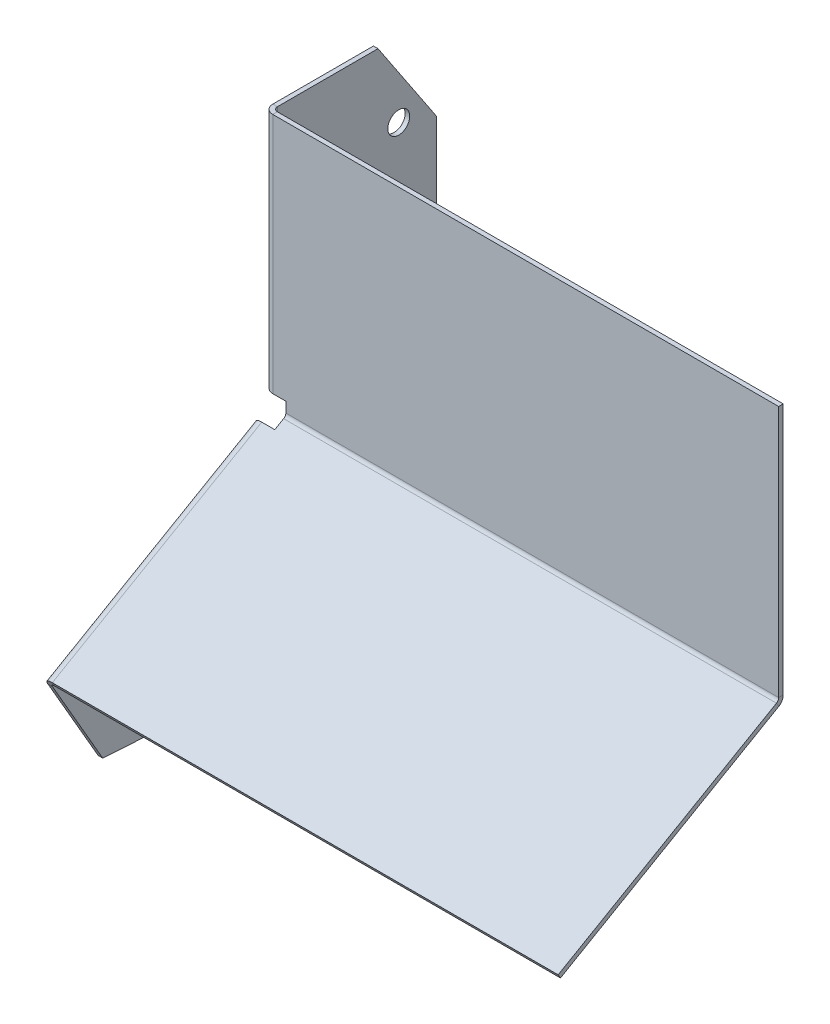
ISO-10303-21;
HEADER;
FILE_DESCRIPTION(('STEP AP214'),'2;1');
FILE_NAME('part.step','',(''),(''),'','','');
FILE_SCHEMA(('AUTOMOTIVE_DESIGN { 1 0 10303 214 1 1 1 1 }'));
ENDSEC;
DATA;
#1=APPLICATION_CONTEXT('core data for automotive mechanical design processes');
#2=APPLICATION_PROTOCOL_DEFINITION('international standard','automotive_design',2000,#1);
#3=PRODUCT_CONTEXT('',#1,'mechanical');
#4=PRODUCT('Part','Part','',(#3));
#5=PRODUCT_RELATED_PRODUCT_CATEGORY('part','',(#4));
#6=PRODUCT_DEFINITION_FORMATION('','',#4);
#7=PRODUCT_DEFINITION_CONTEXT('part definition',#1,'design');
#8=PRODUCT_DEFINITION('design','',#6,#7);
#9=PRODUCT_DEFINITION_SHAPE('','',#8);
#10=(LENGTH_UNIT() NAMED_UNIT(*) SI_UNIT(.MILLI.,.METRE.));
#11=(NAMED_UNIT(*) PLANE_ANGLE_UNIT() SI_UNIT($,.RADIAN.));
#12=(NAMED_UNIT(*) SI_UNIT($,.STERADIAN.) SOLID_ANGLE_UNIT());
#13=UNCERTAINTY_MEASURE_WITH_UNIT(LENGTH_MEASURE(1.E-05),#10,'distance_accuracy_value','');
#14=(GEOMETRIC_REPRESENTATION_CONTEXT(3) GLOBAL_UNCERTAINTY_ASSIGNED_CONTEXT((#13)) GLOBAL_UNIT_ASSIGNED_CONTEXT((#10,
#11,#12)) REPRESENTATION_CONTEXT('',''));
#15=CARTESIAN_POINT('',(0.,0.,0.));
#16=DIRECTION('',(0.,0.,1.));
#17=DIRECTION('',(1.,0.,0.));
#18=AXIS2_PLACEMENT_3D('',#15,#16,#17);
#19=CARTESIAN_POINT('',(88.2544282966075,-19.7841838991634,40.9061950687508));
#20=DIRECTION('',(1.,0.,0.));
#21=DIRECTION('',(0.,-0.866025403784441,-0.499999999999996));
#22=AXIS2_PLACEMENT_3D('',#19,#20,#21);
#23=PLANE('',#22);
#24=DIRECTION('',(0.,-0.866025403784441,-0.499999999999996));
#25=VECTOR('',#24,1.);
#26=CARTESIAN_POINT('',(88.2544282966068,-38.4816723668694,30.1111950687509));
#27=LINE('',#26,#25);
#28=CARTESIAN_POINT('',(88.2544282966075,-23.3220520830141,38.8636059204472));
#29=VERTEX_POINT('',#28);
#30=CARTESIAN_POINT('',(88.2544282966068,-38.4816723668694,30.1111950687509));
#31=VERTEX_POINT('',#30);
#32=EDGE_CURVE('E290',#29,#31,#27,.T.);
#33=ORIENTED_EDGE('',*,*,#32,.F.);
#34=DIRECTION('',(0.,0.499999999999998,-0.866025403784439));
#35=VECTOR('',#34,1.);
#36=CARTESIAN_POINT('',(88.2544282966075,-23.3220520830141,38.8636059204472));
#37=LINE('',#36,#35);
#38=CARTESIAN_POINT('',(88.2544282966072,-2.28767708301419,2.43099971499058));
#39=VERTEX_POINT('',#38);
#40=EDGE_CURVE('E303',#29,#39,#37,.T.);
#41=ORIENTED_EDGE('',*,*,#40,.T.);
#42=DIRECTION('',(0.,0.866025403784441,0.499999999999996));
#43=VECTOR('',#42,1.);
#44=CARTESIAN_POINT('',(88.2544282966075,1.25019110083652,4.47358886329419));
#45=LINE('',#44,#43);
#46=CARTESIAN_POINT('',(88.2544282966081,-26.2461154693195,-11.4014111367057));
#47=VERTEX_POINT('',#46);
#48=EDGE_CURVE('E287',#47,#39,#45,.T.);
#49=ORIENTED_EDGE('',*,*,#48,.F.);
#50=DIRECTION('',(0.,0.499999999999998,-0.866025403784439));
#51=VECTOR('',#50,1.);
#52=CARTESIAN_POINT('',(88.2544282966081,-26.2461154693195,-11.4014111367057));
#53=LINE('',#52,#51);
#54=CARTESIAN_POINT('',(88.2544282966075,-39.6604904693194,11.8329679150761));
#55=VERTEX_POINT('',#54);
#56=EDGE_CURVE('E266',#55,#47,#53,.T.);
#57=ORIENTED_EDGE('',*,*,#56,.F.);
#58=DIRECTION('',(0.,-0.0643593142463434,-0.997926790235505));
#59=VECTOR('',#58,1.);
#60=CARTESIAN_POINT('',(88.2544282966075,-39.6604904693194,11.8329679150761));
#61=LINE('',#60,#59);
#62=EDGE_CURVE('E269',#31,#55,#61,.T.);
#63=ORIENTED_EDGE('',*,*,#62,.F.);
#64=EDGE_LOOP('',(#33,#41,#49,#57,#63));
#65=FACE_BOUND('',#64,.T.);
#66=CARTESIAN_POINT('',(88.2544282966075,-35.1470492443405,17.1153434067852));
#67=DIRECTION('',(1.,0.,0.));
#68=DIRECTION('',(0.,0.,-0.999999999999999));
#69=AXIS2_PLACEMENT_3D('',#66,#67,#68);
#70=CIRCLE('',#69,1.905);
#71=CARTESIAN_POINT('',(88.2544282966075,-35.1470492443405,19.0203434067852));
#72=VERTEX_POINT('',#71);
#73=EDGE_CURVE('E349',#72,#72,#70,.F.);
#74=ORIENTED_EDGE('',*,*,#73,.F.);
#75=EDGE_LOOP('',(#74));
#76=FACE_BOUND('',#75,.T.);
#77=ADVANCED_FACE('F32',(#65,#76),#23,.F.);
#78=CARTESIAN_POINT('',(89.0481782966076,-19.7841838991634,40.9061950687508));
#79=DIRECTION('',(1.,0.,0.));
#80=DIRECTION('',(0.,-0.866025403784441,-0.499999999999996));
#81=AXIS2_PLACEMENT_3D('',#78,#79,#80);
#82=PLANE('',#81);
#83=DIRECTION('',(0.,0.499999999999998,-0.866025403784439));
#84=VECTOR('',#83,1.);
#85=CARTESIAN_POINT('',(89.0481782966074,-23.3220520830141,38.8636059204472));
#86=LINE('',#85,#84);
#87=CARTESIAN_POINT('',(89.0481782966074,-23.3220520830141,38.8636059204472));
#88=VERTEX_POINT('',#87);
#89=CARTESIAN_POINT('',(89.0481782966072,-2.28767708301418,2.43099971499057));
#90=VERTEX_POINT('',#89);
#91=EDGE_CURVE('E306',#88,#90,#86,.T.);
#92=ORIENTED_EDGE('',*,*,#91,.F.);
#93=DIRECTION('',(0.,-0.866025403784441,-0.499999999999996));
#94=VECTOR('',#93,1.);
#95=CARTESIAN_POINT('',(89.0481782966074,-38.4816723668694,30.1111950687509));
#96=LINE('',#95,#94);
#97=CARTESIAN_POINT('',(89.0481782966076,-38.4816723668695,30.1111950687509));
#98=VERTEX_POINT('',#97);
#99=EDGE_CURVE('E292',#88,#98,#96,.T.);
#100=ORIENTED_EDGE('',*,*,#99,.T.);
#101=DIRECTION('',(0.,-0.0643593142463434,-0.997926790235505));
#102=VECTOR('',#101,1.);
#103=CARTESIAN_POINT('',(89.0481782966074,-39.6604904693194,11.8329679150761));
#104=LINE('',#103,#102);
#105=CARTESIAN_POINT('',(89.0481782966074,-39.6604904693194,11.8329679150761));
#106=VERTEX_POINT('',#105);
#107=EDGE_CURVE('E272',#98,#106,#104,.T.);
#108=ORIENTED_EDGE('',*,*,#107,.T.);
#109=DIRECTION('',(0.,0.499999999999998,-0.866025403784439));
#110=VECTOR('',#109,1.);
#111=CARTESIAN_POINT('',(89.0481782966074,-26.2461154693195,-11.4014111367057));
#112=LINE('',#111,#110);
#113=CARTESIAN_POINT('',(89.0481782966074,-26.2461154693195,-11.4014111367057));
#114=VERTEX_POINT('',#113);
#115=EDGE_CURVE('E275',#106,#114,#112,.T.);
#116=ORIENTED_EDGE('',*,*,#115,.T.);
#117=DIRECTION('',(0.,0.866025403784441,0.499999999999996));
#118=VECTOR('',#117,1.);
#119=CARTESIAN_POINT('',(89.0481782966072,1.25019110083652,4.47358886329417));
#120=LINE('',#119,#118);
#121=EDGE_CURVE('E294',#114,#90,#120,.T.);
#122=ORIENTED_EDGE('',*,*,#121,.T.);
#123=EDGE_LOOP('',(#92,#100,#108,#116,#122));
#124=FACE_BOUND('',#123,.T.);
#125=CARTESIAN_POINT('',(89.0481782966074,-35.1470492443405,17.1153434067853));
#126=DIRECTION('',(1.,0.,0.));
#127=DIRECTION('',(0.,0.,-0.999999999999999));
#128=AXIS2_PLACEMENT_3D('',#125,#126,#127);
#129=CIRCLE('',#128,1.905);
#130=CARTESIAN_POINT('',(89.0481782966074,-35.1470492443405,19.0203434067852));
#131=VERTEX_POINT('',#130);
#132=EDGE_CURVE('E36',#131,#131,#129,.F.);
#133=ORIENTED_EDGE('',*,*,#132,.T.);
#134=EDGE_LOOP('',(#133));
#135=FACE_BOUND('',#134,.T.);
#136=ADVANCED_FACE('F463',(#124,#135),#82,.T.);
#137=CARTESIAN_POINT('',(88.254428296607,-44.45,3.82057170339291));
#138=DIRECTION('',(1.,0.,0.));
#139=DIRECTION('',(0.,0.,-0.999999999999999));
#140=AXIS2_PLACEMENT_3D('',#137,#138,#139);
#141=PLANE('',#140);
#142=DIRECTION('',(0.,0.,-0.999999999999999));
#143=VECTOR('',#142,1.);
#144=CARTESIAN_POINT('',(88.2544282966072,2.38124999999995,-27.9294282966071));
#145=LINE('',#144,#143);
#146=CARTESIAN_POINT('',(88.2544282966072,2.38124999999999,-0.264606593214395));
#147=VERTEX_POINT('',#146);
#148=CARTESIAN_POINT('',(88.2544282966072,2.38124999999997,-27.9294282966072));
#149=VERTEX_POINT('',#148);
#150=EDGE_CURVE('E401',#147,#149,#145,.T.);
#151=ORIENTED_EDGE('',*,*,#150,.F.);
#152=DIRECTION('',(0.,1.,0.));
#153=VECTOR('',#152,1.);
#154=CARTESIAN_POINT('',(88.254428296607,-44.45,-0.264606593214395));
#155=LINE('',#154,#153);
#156=CARTESIAN_POINT('',(88.254428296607,44.45,-0.264606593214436));
#157=VERTEX_POINT('',#156);
#158=EDGE_CURVE('E414',#147,#157,#155,.T.);
#159=ORIENTED_EDGE('',*,*,#158,.T.);
#160=DIRECTION('',(0.,0.,0.999999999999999));
#161=VECTOR('',#160,1.);
#162=CARTESIAN_POINT('',(88.2544282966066,44.4500000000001,89.5455717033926));
#163=LINE('',#162,#161);
#164=CARTESIAN_POINT('',(88.254428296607,44.45,-17.7694282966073));
#165=VERTEX_POINT('',#164);
#166=EDGE_CURVE('E398',#165,#157,#163,.T.);
#167=ORIENTED_EDGE('',*,*,#166,.F.);
#168=DIRECTION('',(0.,0.832050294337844,0.554700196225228));
#169=VECTOR('',#168,1.);
#170=CARTESIAN_POINT('',(88.254428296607,44.45,-17.7694282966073));
#171=LINE('',#170,#169);
#172=CARTESIAN_POINT('',(88.254428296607,29.21,-27.9294282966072));
#173=VERTEX_POINT('',#172);
#174=EDGE_CURVE('E377',#173,#165,#171,.T.);
#175=ORIENTED_EDGE('',*,*,#174,.F.);
#176=DIRECTION('',(0.,1.,0.));
#177=VECTOR('',#176,1.);
#178=CARTESIAN_POINT('',(88.254428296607,29.21,-27.9294282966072));
#179=LINE('',#178,#177);
#180=EDGE_CURVE('E380',#149,#173,#179,.T.);
#181=ORIENTED_EDGE('',*,*,#180,.F.);
#182=EDGE_LOOP('',(#151,#159,#167,#175,#181));
#183=FACE_BOUND('',#182,.T.);
#184=CARTESIAN_POINT('',(88.254428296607,31.5279507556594,-21.3794857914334));
#185=DIRECTION('',(1.,0.,0.));
#186=DIRECTION('',(0.,0.,-0.999999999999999));
#187=AXIS2_PLACEMENT_3D('',#184,#185,#186);
#188=CIRCLE('',#187,1.905);
#189=CARTESIAN_POINT('',(88.254428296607,31.5279507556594,-19.4744857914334));
#190=VERTEX_POINT('',#189);
#191=EDGE_CURVE('E204',#190,#190,#188,.F.);
#192=ORIENTED_EDGE('',*,*,#191,.F.);
#193=EDGE_LOOP('',(#192));
#194=FACE_BOUND('',#193,.T.);
#195=ADVANCED_FACE('F460',(#183,#194),#141,.F.);
#196=CARTESIAN_POINT('',(89.0481782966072,-44.45,3.82057170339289));
#197=DIRECTION('',(1.,0.,0.));
#198=DIRECTION('',(0.,0.,-0.999999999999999));
#199=AXIS2_PLACEMENT_3D('',#196,#197,#198);
#200=PLANE('',#199);
#201=DIRECTION('',(0.,1.,0.));
#202=VECTOR('',#201,1.);
#203=CARTESIAN_POINT('',(89.0481782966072,-44.45,-0.264606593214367));
#204=LINE('',#203,#202);
#205=CARTESIAN_POINT('',(89.0481782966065,2.38125,-0.264606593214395));
#206=VERTEX_POINT('',#205);
#207=CARTESIAN_POINT('',(89.0481782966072,44.45,-0.26460659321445));
#208=VERTEX_POINT('',#207);
#209=EDGE_CURVE('E417',#206,#208,#204,.T.);
#210=ORIENTED_EDGE('',*,*,#209,.F.);
#211=DIRECTION('',(0.,0.,-0.999999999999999));
#212=VECTOR('',#211,1.);
#213=CARTESIAN_POINT('',(89.0481782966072,2.38124999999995,-27.9294282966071));
#214=LINE('',#213,#212);
#215=CARTESIAN_POINT('',(89.0481782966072,2.38124999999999,-27.9294282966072));
#216=VERTEX_POINT('',#215);
#217=EDGE_CURVE('E406',#206,#216,#214,.T.);
#218=ORIENTED_EDGE('',*,*,#217,.T.);
#219=DIRECTION('',(0.,1.,0.));
#220=VECTOR('',#219,1.);
#221=CARTESIAN_POINT('',(89.0481782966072,29.21,-27.9294282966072));
#222=LINE('',#221,#220);
#223=CARTESIAN_POINT('',(89.0481782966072,29.21,-27.9294282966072));
#224=VERTEX_POINT('',#223);
#225=EDGE_CURVE('E383',#216,#224,#222,.T.);
#226=ORIENTED_EDGE('',*,*,#225,.T.);
#227=DIRECTION('',(0.,0.832050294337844,0.554700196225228));
#228=VECTOR('',#227,1.);
#229=CARTESIAN_POINT('',(89.0481782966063,44.45,-17.7694282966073));
#230=LINE('',#229,#228);
#231=CARTESIAN_POINT('',(89.0481782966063,44.45,-17.7694282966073));
#232=VERTEX_POINT('',#231);
#233=EDGE_CURVE('E386',#224,#232,#230,.T.);
#234=ORIENTED_EDGE('',*,*,#233,.T.);
#235=DIRECTION('',(0.,0.,0.999999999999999));
#236=VECTOR('',#235,1.);
#237=CARTESIAN_POINT('',(89.0481782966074,44.4500000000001,89.5455717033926));
#238=LINE('',#237,#236);
#239=EDGE_CURVE('E403',#232,#208,#238,.T.);
#240=ORIENTED_EDGE('',*,*,#239,.T.);
#241=EDGE_LOOP('',(#210,#218,#226,#234,#240));
#242=FACE_BOUND('',#241,.T.);
#243=CARTESIAN_POINT('',(89.0481782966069,31.5279507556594,-21.3794857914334));
#244=DIRECTION('',(1.,0.,0.));
#245=DIRECTION('',(0.,0.,-0.999999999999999));
#246=AXIS2_PLACEMENT_3D('',#243,#244,#245);
#247=CIRCLE('',#246,1.905);
#248=CARTESIAN_POINT('',(89.0481782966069,31.5279507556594,-19.4744857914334));
#249=VERTEX_POINT('',#248);
#250=EDGE_CURVE('E347',#249,#249,#247,.F.);
#251=ORIENTED_EDGE('',*,*,#250,.T.);
#252=EDGE_LOOP('',(#251));
#253=FACE_BOUND('',#252,.T.);
#254=ADVANCED_FACE('F440',(#242,#253),#200,.T.);
#255=CARTESIAN_POINT('',(92.0750000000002,-22.6621407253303,39.2446059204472));
#256=DIRECTION('',(0.,-0.86602540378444,-0.499999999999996));
#257=DIRECTION('',(-1.,0.,0.));
#258=AXIS2_PLACEMENT_3D('',#255,#256,#257);
#259=PLANE('',#258);
#260=DIRECTION('',(0.,0.499999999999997,-0.866025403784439));
#261=VECTOR('',#260,1.);
#262=CARTESIAN_POINT('',(92.0749999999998,0.753484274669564,-1.31244627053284));
#263=LINE('',#262,#261);
#264=CARTESIAN_POINT('',(92.075,-1.62776572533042,2.81199971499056));
#265=VERTEX_POINT('',#264);
#266=CARTESIAN_POINT('',(92.0750000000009,-0.740533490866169,1.27526840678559));
#267=VERTEX_POINT('',#266);
#268=EDGE_CURVE('E324',#265,#267,#263,.T.);
#269=ORIENTED_EDGE('',*,*,#268,.T.);
#270=DIRECTION('',(1.,0.,0.));
#271=VECTOR('',#270,1.);
#272=CARTESIAN_POINT('',(92.0750000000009,-0.740533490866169,1.27526840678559));
#273=LINE('',#272,#271);
#274=CARTESIAN_POINT('',(177.8,-0.740533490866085,1.27526840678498));
#275=VERTEX_POINT('',#274);
#276=EDGE_CURVE('E56',#267,#275,#273,.T.);
#277=ORIENTED_EDGE('',*,*,#276,.T.);
#278=DIRECTION('',(0.,-0.499999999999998,0.866025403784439));
#279=VECTOR('',#278,1.);
#280=CARTESIAN_POINT('',(177.8,-22.6621407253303,39.2446059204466));
#281=LINE('',#280,#279);
#282=CARTESIAN_POINT('',(177.8,-22.6621407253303,39.2446059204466));
#283=VERTEX_POINT('',#282);
#284=EDGE_CURVE('E317',#275,#283,#281,.T.);
#285=ORIENTED_EDGE('',*,*,#284,.T.);
#286=DIRECTION('',(-1.,0.,0.));
#287=VECTOR('',#286,1.);
#288=CARTESIAN_POINT('',(70.4849999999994,-22.6621407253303,39.2446059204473));
#289=LINE('',#288,#287);
#290=CARTESIAN_POINT('',(89.8101782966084,-22.6621407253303,39.2446059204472));
#291=VERTEX_POINT('',#290);
#292=EDGE_CURVE('E319',#283,#291,#289,.T.);
#293=ORIENTED_EDGE('',*,*,#292,.T.);
#294=DIRECTION('',(0.,0.499999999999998,-0.866025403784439));
#295=VECTOR('',#294,1.);
#296=CARTESIAN_POINT('',(89.8101782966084,-22.6621407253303,39.2446059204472));
#297=LINE('',#296,#295);
#298=CARTESIAN_POINT('',(89.8101782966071,-1.62776572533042,2.81199971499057));
#299=VERTEX_POINT('',#298);
#300=EDGE_CURVE('E332',#291,#299,#297,.T.);
#301=ORIENTED_EDGE('',*,*,#300,.T.);
#302=DIRECTION('',(1.,0.,0.));
#303=VECTOR('',#302,1.);
#304=CARTESIAN_POINT('',(92.075,-1.62776572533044,2.81199971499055));
#305=LINE('',#304,#303);
#306=EDGE_CURVE('E322',#299,#265,#305,.T.);
#307=ORIENTED_EDGE('',*,*,#306,.T.);
#308=EDGE_LOOP('',(#269,#277,#285,#293,#301,#307));
#309=FACE_BOUND('',#308,.T.);
#310=ADVANCED_FACE('F507',(#309),#259,.T.);
#311=CARTESIAN_POINT('',(92.075,-21.9747330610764,39.6414809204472));
#312=DIRECTION('',(0.,-0.86602540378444,-0.499999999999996));
#313=DIRECTION('',(-1.,0.,0.));
#314=AXIS2_PLACEMENT_3D('',#311,#312,#313);
#315=PLANE('',#314);
#316=DIRECTION('',(1.,0.,0.));
#317=VECTOR('',#316,1.);
#318=CARTESIAN_POINT('',(92.075,-0.053125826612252,1.6721434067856));
#319=LINE('',#318,#317);
#320=CARTESIAN_POINT('',(92.075,-0.0531258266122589,1.67214340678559));
#321=VERTEX_POINT('',#320);
#322=CARTESIAN_POINT('',(177.8,-0.0531258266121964,1.67214340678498));
#323=VERTEX_POINT('',#322);
#324=EDGE_CURVE('E345',#321,#323,#319,.T.);
#325=ORIENTED_EDGE('',*,*,#324,.F.);
#326=DIRECTION('',(0.,0.499999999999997,-0.866025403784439));
#327=VECTOR('',#326,1.);
#328=CARTESIAN_POINT('',(92.075,1.44089193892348,-0.915571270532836));
#329=LINE('',#328,#327);
#330=CARTESIAN_POINT('',(92.0750000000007,-0.940358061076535,3.20887471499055));
#331=VERTEX_POINT('',#330);
#332=EDGE_CURVE('E308',#331,#321,#329,.T.);
#333=ORIENTED_EDGE('',*,*,#332,.F.);
#334=DIRECTION('',(1.,0.,0.));
#335=VECTOR('',#334,1.);
#336=CARTESIAN_POINT('',(92.0750000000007,-0.940358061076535,3.20887471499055));
#337=LINE('',#336,#335);
#338=CARTESIAN_POINT('',(89.810178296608,-0.940358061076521,3.20887471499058));
#339=VERTEX_POINT('',#338);
#340=EDGE_CURVE('E310',#339,#331,#337,.T.);
#341=ORIENTED_EDGE('',*,*,#340,.F.);
#342=DIRECTION('',(0.,0.499999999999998,-0.866025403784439));
#343=VECTOR('',#342,1.);
#344=CARTESIAN_POINT('',(89.8101782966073,-21.9747330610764,39.6414809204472));
#345=LINE('',#344,#343);
#346=CARTESIAN_POINT('',(89.8101782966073,-21.9747330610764,39.6414809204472));
#347=VERTEX_POINT('',#346);
#348=EDGE_CURVE('E335',#347,#339,#345,.T.);
#349=ORIENTED_EDGE('',*,*,#348,.F.);
#350=DIRECTION('',(-1.,0.,0.));
#351=VECTOR('',#350,1.);
#352=CARTESIAN_POINT('',(70.4850000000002,-21.9747330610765,39.6414809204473));
#353=LINE('',#352,#351);
#354=CARTESIAN_POINT('',(177.8,-21.9747330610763,39.6414809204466));
#355=VERTEX_POINT('',#354);
#356=EDGE_CURVE('E312',#355,#347,#353,.T.);
#357=ORIENTED_EDGE('',*,*,#356,.F.);
#358=DIRECTION('',(0.,-0.499999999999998,0.866025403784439));
#359=VECTOR('',#358,1.);
#360=CARTESIAN_POINT('',(177.8,-21.9747330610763,39.6414809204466));
#361=LINE('',#360,#359);
#362=EDGE_CURVE('E315',#323,#355,#361,.T.);
#363=ORIENTED_EDGE('',*,*,#362,.F.);
#364=EDGE_LOOP('',(#325,#333,#341,#349,#357,#363));
#365=FACE_BOUND('',#364,.T.);
#366=ADVANCED_FACE('F504',(#365),#315,.F.);
#367=CARTESIAN_POINT('',(177.799999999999,-239.309910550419,-85.8370423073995));
#368=DIRECTION('',(-1.,0.,0.));
#369=DIRECTION('',(0.,0.499999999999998,-0.866025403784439));
#370=AXIS2_PLACEMENT_3D('',#367,#368,#369);
#371=PLANE('',#370);
#372=DIRECTION('',(0.,-0.86602540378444,-0.499999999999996));
#373=VECTOR('',#372,1.);
#374=CARTESIAN_POINT('',(177.799999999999,-217.388303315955,-123.806379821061));
#375=LINE('',#374,#373);
#376=EDGE_CURVE('E41',#323,#275,#375,.T.);
#377=ORIENTED_EDGE('',*,*,#376,.F.);
#378=ORIENTED_EDGE('',*,*,#362,.T.);
#379=DIRECTION('',(0.,0.86602540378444,0.499999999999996));
#380=VECTOR('',#379,1.);
#381=CARTESIAN_POINT('',(177.799999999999,-239.309910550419,-85.8370423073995));
#382=LINE('',#381,#380);
#383=EDGE_CURVE('E329',#283,#355,#382,.T.);
#384=ORIENTED_EDGE('',*,*,#383,.F.);
#385=ORIENTED_EDGE('',*,*,#284,.F.);
#386=EDGE_LOOP('',(#377,#378,#384,#385));
#387=FACE_BOUND('',#386,.T.);
#388=ADVANCED_FACE('F34',(#387),#371,.F.);
#389=CARTESIAN_POINT('',(70.4849999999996,-239.309910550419,-85.8370423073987));
#390=DIRECTION('',(0.,0.499999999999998,-0.866025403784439));
#391=DIRECTION('',(1.,0.,0.));
#392=AXIS2_PLACEMENT_3D('',#389,#390,#391);
#393=PLANE('',#392);
#394=DIRECTION('',(0.,0.86602540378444,0.499999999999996));
#395=VECTOR('',#394,1.);
#396=CARTESIAN_POINT('',(89.8101782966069,-239.309910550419,-85.8370423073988));
#397=LINE('',#396,#395);
#398=EDGE_CURVE('E338',#291,#347,#397,.T.);
#399=ORIENTED_EDGE('',*,*,#398,.F.);
#400=ORIENTED_EDGE('',*,*,#292,.F.);
#401=ORIENTED_EDGE('',*,*,#383,.T.);
#402=ORIENTED_EDGE('',*,*,#356,.T.);
#403=EDGE_LOOP('',(#399,#400,#401,#402));
#404=FACE_BOUND('',#403,.T.);
#405=ADVANCED_FACE('F516',(#404),#393,.F.);
#406=CARTESIAN_POINT('',(92.0749999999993,-218.275535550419,-122.269648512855));
#407=DIRECTION('',(0.,-0.499999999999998,0.866025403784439));
#408=DIRECTION('',(-1.,0.,0.));
#409=AXIS2_PLACEMENT_3D('',#406,#407,#408);
#410=PLANE('',#409);
#411=DIRECTION('',(0.,-0.86602540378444,-0.499999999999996));
#412=VECTOR('',#411,1.);
#413=CARTESIAN_POINT('',(89.8101782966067,-218.27553555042,-122.269648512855));
#414=LINE('',#413,#412);
#415=EDGE_CURVE('E341',#339,#299,#414,.T.);
#416=ORIENTED_EDGE('',*,*,#415,.F.);
#417=ORIENTED_EDGE('',*,*,#340,.T.);
#418=DIRECTION('',(0.,0.86602540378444,0.499999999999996));
#419=VECTOR('',#418,1.);
#420=CARTESIAN_POINT('',(92.0749999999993,-218.275535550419,-122.269648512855));
#421=LINE('',#420,#419);
#422=EDGE_CURVE('E326',#265,#331,#421,.T.);
#423=ORIENTED_EDGE('',*,*,#422,.F.);
#424=ORIENTED_EDGE('',*,*,#306,.F.);
#425=EDGE_LOOP('',(#416,#417,#423,#424));
#426=FACE_BOUND('',#425,.T.);
#427=ADVANCED_FACE('F513',(#426),#410,.F.);
#428=CARTESIAN_POINT('',(92.0749999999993,-215.894285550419,-126.394094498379));
#429=DIRECTION('',(1.,0.,0.));
#430=DIRECTION('',(0.,-0.86602540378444,-0.499999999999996));
#431=AXIS2_PLACEMENT_3D('',#428,#429,#430);
#432=PLANE('',#431);
#433=DIRECTION('',(0.,0.86602540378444,0.499999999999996));
#434=VECTOR('',#433,1.);
#435=CARTESIAN_POINT('',(92.0749999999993,-217.388303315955,-123.80637982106));
#436=LINE('',#435,#434);
#437=EDGE_CURVE('E11',#267,#321,#436,.T.);
#438=ORIENTED_EDGE('',*,*,#437,.F.);
#439=ORIENTED_EDGE('',*,*,#268,.F.);
#440=ORIENTED_EDGE('',*,*,#422,.T.);
#441=ORIENTED_EDGE('',*,*,#332,.T.);
#442=EDGE_LOOP('',(#438,#439,#440,#441));
#443=FACE_BOUND('',#442,.T.);
#444=ADVANCED_FACE('F502',(#443),#432,.F.);
#445=CARTESIAN_POINT('',(339.211474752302,-38.4816723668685,30.1111950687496));
#446=DIRECTION('',(0.,0.499999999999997,-0.866025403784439));
#447=DIRECTION('',(0.,0.866025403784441,0.499999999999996));
#448=AXIS2_PLACEMENT_3D('',#445,#446,#447);
#449=PLANE('',#448);
#450=ORIENTED_EDGE('',*,*,#99,.F.);
#451=DIRECTION('',(-1.,0.,0.));
#452=VECTOR('',#451,1.);
#453=CARTESIAN_POINT('',(339.211474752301,-23.3220520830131,38.8636059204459));
#454=LINE('',#453,#452);
#455=EDGE_CURVE('E300',#88,#29,#454,.T.);
#456=ORIENTED_EDGE('',*,*,#455,.T.);
#457=ORIENTED_EDGE('',*,*,#32,.T.);
#458=DIRECTION('',(-1.,0.,0.));
#459=VECTOR('',#458,1.);
#460=CARTESIAN_POINT('',(189.748170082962,-38.481672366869,30.1111950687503));
#461=LINE('',#460,#459);
#462=EDGE_CURVE('E284',#98,#31,#461,.T.);
#463=ORIENTED_EDGE('',*,*,#462,.F.);
#464=EDGE_LOOP('',(#450,#456,#457,#463));
#465=FACE_BOUND('',#464,.T.);
#466=ADVANCED_FACE('F498',(#465),#449,.F.);
#467=CARTESIAN_POINT('',(339.211474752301,1.25019110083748,4.47358886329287));
#468=DIRECTION('',(0.,-0.499999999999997,0.86602540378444));
#469=DIRECTION('',(0.,-0.866025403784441,-0.499999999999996));
#470=AXIS2_PLACEMENT_3D('',#467,#468,#469);
#471=PLANE('',#470);
#472=ORIENTED_EDGE('',*,*,#48,.T.);
#473=DIRECTION('',(1.,0.,0.));
#474=VECTOR('',#473,1.);
#475=CARTESIAN_POINT('',(339.211474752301,-2.28767708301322,2.43099971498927));
#476=LINE('',#475,#474);
#477=EDGE_CURVE('E297',#39,#90,#476,.T.);
#478=ORIENTED_EDGE('',*,*,#477,.T.);
#479=ORIENTED_EDGE('',*,*,#121,.F.);
#480=DIRECTION('',(-1.,0.,0.));
#481=VECTOR('',#480,1.);
#482=CARTESIAN_POINT('',(189.748170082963,-26.2461154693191,-11.4014111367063));
#483=LINE('',#482,#481);
#484=EDGE_CURVE('E278',#114,#47,#483,.T.);
#485=ORIENTED_EDGE('',*,*,#484,.T.);
#486=EDGE_LOOP('',(#472,#478,#479,#485));
#487=FACE_BOUND('',#486,.T.);
#488=ADVANCED_FACE('F495',(#487),#471,.F.);
#489=CARTESIAN_POINT('',(189.748170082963,-39.660490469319,11.8329679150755));
#490=DIRECTION('',(0.,0.997926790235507,-0.0643593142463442));
#491=DIRECTION('',(0.,0.0643593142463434,0.997926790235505));
#492=AXIS2_PLACEMENT_3D('',#489,#490,#491);
#493=PLANE('',#492);
#494=ORIENTED_EDGE('',*,*,#462,.T.);
#495=ORIENTED_EDGE('',*,*,#62,.T.);
#496=DIRECTION('',(-1.,0.,0.));
#497=VECTOR('',#496,1.);
#498=CARTESIAN_POINT('',(189.748170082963,-39.660490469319,11.8329679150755));
#499=LINE('',#498,#497);
#500=EDGE_CURVE('E281',#106,#55,#499,.T.);
#501=ORIENTED_EDGE('',*,*,#500,.F.);
#502=ORIENTED_EDGE('',*,*,#107,.F.);
#503=EDGE_LOOP('',(#494,#495,#501,#502));
#504=FACE_BOUND('',#503,.T.);
#505=ADVANCED_FACE('F492',(#504),#493,.F.);
#506=CARTESIAN_POINT('',(189.748170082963,-26.2461154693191,-11.4014111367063));
#507=DIRECTION('',(0.,0.866025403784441,0.499999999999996));
#508=DIRECTION('',(0.,-0.499999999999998,0.866025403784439));
#509=AXIS2_PLACEMENT_3D('',#506,#507,#508);
#510=PLANE('',#509);
#511=ORIENTED_EDGE('',*,*,#500,.T.);
#512=ORIENTED_EDGE('',*,*,#56,.T.);
#513=ORIENTED_EDGE('',*,*,#484,.F.);
#514=ORIENTED_EDGE('',*,*,#115,.F.);
#515=EDGE_LOOP('',(#511,#512,#513,#514));
#516=FACE_BOUND('',#515,.T.);
#517=ADVANCED_FACE('F544',(#516),#510,.F.);
#518=CARTESIAN_POINT('',(89.8101782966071,-2.28767708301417,2.43099971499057));
#519=DIRECTION('',(0.,-0.499999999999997,0.866025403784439));
#520=DIRECTION('',(0.,-0.866025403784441,-0.499999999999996));
#521=AXIS2_PLACEMENT_3D('',#518,#519,#520);
#522=PLANE('',#521);
#523=ORIENTED_EDGE('',*,*,#415,.T.);
#524=CARTESIAN_POINT('',(89.8101782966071,-2.28767708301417,2.43099971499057));
#525=DIRECTION('',(0.,-0.499999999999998,0.866025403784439));
#526=DIRECTION('',(0.,-0.866025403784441,-0.499999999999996));
#527=AXIS2_PLACEMENT_3D('',#524,#525,#526);
#528=CIRCLE('',#527,0.762000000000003);
#529=EDGE_CURVE('E258',#90,#299,#528,.F.);
#530=ORIENTED_EDGE('',*,*,#529,.F.);
#531=ORIENTED_EDGE('',*,*,#477,.F.);
#532=CARTESIAN_POINT('',(89.8101782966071,-2.28767708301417,2.43099971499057));
#533=DIRECTION('',(0.,-0.499999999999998,0.866025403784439));
#534=DIRECTION('',(0.,-0.866025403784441,-0.499999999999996));
#535=AXIS2_PLACEMENT_3D('',#532,#533,#534);
#536=CIRCLE('',#535,1.55575);
#537=EDGE_CURVE('E263',#39,#339,#536,.F.);
#538=ORIENTED_EDGE('',*,*,#537,.T.);
#539=EDGE_LOOP('',(#523,#530,#531,#538));
#540=FACE_BOUND('',#539,.T.);
#541=ADVANCED_FACE('F536',(#540),#522,.F.);
#542=CARTESIAN_POINT('',(89.8101782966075,-23.3220520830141,38.8636059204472));
#543=DIRECTION('',(0.,0.500000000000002,-0.866025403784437));
#544=DIRECTION('',(0.,0.866025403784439,0.5));
#545=AXIS2_PLACEMENT_3D('',#542,#543,#544);
#546=PLANE('',#545);
#547=ORIENTED_EDGE('',*,*,#455,.F.);
#548=CARTESIAN_POINT('',(89.8101782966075,-23.3220520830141,38.8636059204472));
#549=DIRECTION('',(0.,-0.499999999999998,0.866025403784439));
#550=DIRECTION('',(0.,-0.866025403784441,-0.499999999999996));
#551=AXIS2_PLACEMENT_3D('',#548,#549,#550);
#552=CIRCLE('',#551,0.762000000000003);
#553=EDGE_CURVE('E255',#291,#88,#552,.T.);
#554=ORIENTED_EDGE('',*,*,#553,.F.);
#555=ORIENTED_EDGE('',*,*,#398,.T.);
#556=CARTESIAN_POINT('',(89.8101782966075,-23.3220520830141,38.8636059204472));
#557=DIRECTION('',(0.,-0.499999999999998,0.866025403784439));
#558=DIRECTION('',(0.,-0.866025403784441,-0.499999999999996));
#559=AXIS2_PLACEMENT_3D('',#556,#557,#558);
#560=CIRCLE('',#559,1.55575);
#561=EDGE_CURVE('E261',#347,#29,#560,.T.);
#562=ORIENTED_EDGE('',*,*,#561,.T.);
#563=EDGE_LOOP('',(#547,#554,#555,#562));
#564=FACE_BOUND('',#563,.T.);
#565=ADVANCED_FACE('F530',(#564),#546,.F.);
#566=CARTESIAN_POINT('',(89.8101782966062,72.8079743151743,-127.638483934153));
#567=DIRECTION('',(0.,-0.499999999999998,0.866025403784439));
#568=DIRECTION('',(0.,-0.866025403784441,-0.499999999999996));
#569=AXIS2_PLACEMENT_3D('',#566,#567,#568);
#570=CYLINDRICAL_SURFACE('',#569,1.55575);
#571=ORIENTED_EDGE('',*,*,#561,.F.);
#572=ORIENTED_EDGE('',*,*,#348,.T.);
#573=ORIENTED_EDGE('',*,*,#537,.F.);
#574=ORIENTED_EDGE('',*,*,#40,.F.);
#575=EDGE_LOOP('',(#571,#572,#573,#574));
#576=FACE_BOUND('',#575,.T.);
#577=ADVANCED_FACE('F550',(#576),#570,.T.);
#578=CARTESIAN_POINT('',(89.8101782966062,72.8079743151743,-127.638483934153));
#579=DIRECTION('',(0.,-0.499999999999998,0.866025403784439));
#580=DIRECTION('',(0.,-0.866025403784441,-0.499999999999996));
#581=AXIS2_PLACEMENT_3D('',#578,#579,#580);
#582=CYLINDRICAL_SURFACE('',#581,0.762000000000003);
#583=ORIENTED_EDGE('',*,*,#553,.T.);
#584=ORIENTED_EDGE('',*,*,#91,.T.);
#585=ORIENTED_EDGE('',*,*,#529,.T.);
#586=ORIENTED_EDGE('',*,*,#300,.F.);
#587=EDGE_LOOP('',(#583,#584,#585,#586));
#588=FACE_BOUND('',#587,.T.);
#589=ADVANCED_FACE('F533',(#588),#582,.F.);
#590=CARTESIAN_POINT('',(92.0749999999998,-44.45,1.29114340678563));
#591=DIRECTION('',(0.,0.,-0.999999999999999));
#592=DIRECTION('',(-1.,0.,0.));
#593=AXIS2_PLACEMENT_3D('',#590,#591,#592);
#594=PLANE('',#593);
#595=DIRECTION('',(0.,1.,0.));
#596=VECTOR('',#595,1.);
#597=CARTESIAN_POINT('',(92.0750000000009,2.38124999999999,1.29114340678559));
#598=LINE('',#597,#596);
#599=CARTESIAN_POINT('',(92.075,0.606785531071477,1.29114340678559));
#600=VERTEX_POINT('',#599);
#601=CARTESIAN_POINT('',(92.0750000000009,2.38124999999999,1.29114340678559));
#602=VERTEX_POINT('',#601);
#603=EDGE_CURVE('E210',#600,#602,#598,.T.);
#604=ORIENTED_EDGE('',*,*,#603,.F.);
#605=DIRECTION('',(1.,0.,0.));
#606=VECTOR('',#605,1.);
#607=CARTESIAN_POINT('',(92.075,0.606785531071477,1.29114340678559));
#608=LINE('',#607,#606);
#609=CARTESIAN_POINT('',(177.799999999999,0.606785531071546,1.29114340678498));
#610=VERTEX_POINT('',#609);
#611=EDGE_CURVE('E184',#600,#610,#608,.T.);
#612=ORIENTED_EDGE('',*,*,#611,.T.);
#613=DIRECTION('',(0.,-1.,0.));
#614=VECTOR('',#613,1.);
#615=CARTESIAN_POINT('',(177.799999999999,-44.4499999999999,1.29114340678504));
#616=LINE('',#615,#614);
#617=CARTESIAN_POINT('',(177.8,44.4500000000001,1.29114340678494));
#618=VERTEX_POINT('',#617);
#619=EDGE_CURVE('E219',#618,#610,#616,.T.);
#620=ORIENTED_EDGE('',*,*,#619,.F.);
#621=DIRECTION('',(1.,0.,0.));
#622=VECTOR('',#621,1.);
#623=CARTESIAN_POINT('',(177.8,44.4500000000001,1.29114340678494));
#624=LINE('',#623,#622);
#625=CARTESIAN_POINT('',(89.8101782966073,44.45,1.29114340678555));
#626=VERTEX_POINT('',#625);
#627=EDGE_CURVE('E223',#626,#618,#624,.T.);
#628=ORIENTED_EDGE('',*,*,#627,.F.);
#629=DIRECTION('',(0.,1.,0.));
#630=VECTOR('',#629,1.);
#631=CARTESIAN_POINT('',(89.8101782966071,-44.45,1.29114340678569));
#632=LINE('',#631,#630);
#633=CARTESIAN_POINT('',(89.810178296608,2.38125,1.2911434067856));
#634=VERTEX_POINT('',#633);
#635=EDGE_CURVE('E240',#634,#626,#632,.T.);
#636=ORIENTED_EDGE('',*,*,#635,.F.);
#637=DIRECTION('',(-1.,0.,0.));
#638=VECTOR('',#637,1.);
#639=CARTESIAN_POINT('',(60.3250000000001,2.38124999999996,1.29114340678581));
#640=LINE('',#639,#638);
#641=EDGE_CURVE('E217',#602,#634,#640,.T.);
#642=ORIENTED_EDGE('',*,*,#641,.F.);
#643=EDGE_LOOP('',(#604,#612,#620,#628,#636,#642));
#644=FACE_BOUND('',#643,.T.);
#645=ADVANCED_FACE('F215',(#644),#594,.F.);
#646=CARTESIAN_POINT('',(177.799999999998,-44.45,-249.665903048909));
#647=DIRECTION('',(-1.,0.,0.));
#648=DIRECTION('',(0.,1.,0.));
#649=AXIS2_PLACEMENT_3D('',#646,#647,#648);
#650=PLANE('',#649);
#651=ORIENTED_EDGE('',*,*,#619,.T.);
#652=DIRECTION('',(0.,0.,-0.999999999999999));
#653=VECTOR('',#652,1.);
#654=CARTESIAN_POINT('',(177.799999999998,0.606785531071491,-249.665903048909));
#655=LINE('',#654,#653);
#656=CARTESIAN_POINT('',(177.8,0.60678553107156,0.497393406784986));
#657=VERTEX_POINT('',#656);
#658=EDGE_CURVE('E196',#610,#657,#655,.T.);
#659=ORIENTED_EDGE('',*,*,#658,.T.);
#660=DIRECTION('',(0.,-1.,0.));
#661=VECTOR('',#660,1.);
#662=CARTESIAN_POINT('',(177.799999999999,-44.4499999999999,0.497393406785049));
#663=LINE('',#662,#661);
#664=CARTESIAN_POINT('',(177.800000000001,44.4500000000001,0.497393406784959));
#665=VERTEX_POINT('',#664);
#666=EDGE_CURVE('E228',#665,#657,#663,.T.);
#667=ORIENTED_EDGE('',*,*,#666,.F.);
#668=DIRECTION('',(0.,0.,0.999999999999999));
#669=VECTOR('',#668,1.);
#670=CARTESIAN_POINT('',(177.799999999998,44.45,-249.665903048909));
#671=LINE('',#670,#669);
#672=EDGE_CURVE('E237',#665,#618,#671,.T.);
#673=ORIENTED_EDGE('',*,*,#672,.T.);
#674=EDGE_LOOP('',(#651,#659,#667,#673));
#675=FACE_BOUND('',#674,.T.);
#676=ADVANCED_FACE('F424',(#675),#650,.F.);
#677=CARTESIAN_POINT('',(92.0749999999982,2.38124999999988,-249.665903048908));
#678=DIRECTION('',(1.,0.,0.));
#679=DIRECTION('',(0.,0.,-0.999999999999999));
#680=AXIS2_PLACEMENT_3D('',#677,#678,#679);
#681=PLANE('',#680);
#682=DIRECTION('',(0.,1.,0.));
#683=VECTOR('',#682,1.);
#684=CARTESIAN_POINT('',(92.075,2.38125,0.49739340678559));
#685=LINE('',#684,#683);
#686=CARTESIAN_POINT('',(92.075,0.606785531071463,0.49739340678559));
#687=VERTEX_POINT('',#686);
#688=CARTESIAN_POINT('',(92.075,2.38125000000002,0.497393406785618));
#689=VERTEX_POINT('',#688);
#690=EDGE_CURVE('E212',#687,#689,#685,.T.);
#691=ORIENTED_EDGE('',*,*,#690,.F.);
#692=DIRECTION('',(0.,0.,0.999999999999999));
#693=VECTOR('',#692,1.);
#694=CARTESIAN_POINT('',(92.0749999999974,0.606785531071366,-249.665903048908));
#695=LINE('',#694,#693);
#696=EDGE_CURVE('E202',#687,#600,#695,.T.);
#697=ORIENTED_EDGE('',*,*,#696,.T.);
#698=ORIENTED_EDGE('',*,*,#603,.T.);
#699=DIRECTION('',(0.,0.,0.999999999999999));
#700=VECTOR('',#699,1.);
#701=CARTESIAN_POINT('',(92.0749999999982,2.38124999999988,-249.665903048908));
#702=LINE('',#701,#700);
#703=EDGE_CURVE('E235',#689,#602,#702,.T.);
#704=ORIENTED_EDGE('',*,*,#703,.F.);
#705=EDGE_LOOP('',(#691,#697,#698,#704));
#706=FACE_BOUND('',#705,.T.);
#707=ADVANCED_FACE('F208',(#706),#681,.F.);
#708=CARTESIAN_POINT('',(92.075,-44.45,0.497393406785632));
#709=DIRECTION('',(0.,0.,-0.999999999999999));
#710=DIRECTION('',(-1.,0.,0.));
#711=AXIS2_PLACEMENT_3D('',#708,#709,#710);
#712=PLANE('',#711);
#713=DIRECTION('',(1.,0.,0.));
#714=VECTOR('',#713,1.);
#715=CARTESIAN_POINT('',(92.075,0.606785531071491,0.497393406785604));
#716=LINE('',#715,#714);
#717=EDGE_CURVE('E195',#687,#657,#716,.T.);
#718=ORIENTED_EDGE('',*,*,#717,.F.);
#719=ORIENTED_EDGE('',*,*,#690,.T.);
#720=DIRECTION('',(-1.,0.,0.));
#721=VECTOR('',#720,1.);
#722=CARTESIAN_POINT('',(60.3250000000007,2.38124999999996,0.497393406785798));
#723=LINE('',#722,#721);
#724=CARTESIAN_POINT('',(89.8101782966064,2.38124999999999,0.497393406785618));
#725=VERTEX_POINT('',#724);
#726=EDGE_CURVE('E232',#689,#725,#723,.T.);
#727=ORIENTED_EDGE('',*,*,#726,.T.);
#728=DIRECTION('',(0.,1.,0.));
#729=VECTOR('',#728,1.);
#730=CARTESIAN_POINT('',(89.8101782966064,-44.45,0.497393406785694));
#731=LINE('',#730,#729);
#732=CARTESIAN_POINT('',(89.8101782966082,44.45,0.497393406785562));
#733=VERTEX_POINT('',#732);
#734=EDGE_CURVE('E213',#725,#733,#731,.T.);
#735=ORIENTED_EDGE('',*,*,#734,.T.);
#736=DIRECTION('',(1.,0.,0.));
#737=VECTOR('',#736,1.);
#738=CARTESIAN_POINT('',(177.800000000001,44.4500000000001,0.497393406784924));
#739=LINE('',#738,#737);
#740=EDGE_CURVE('E221',#733,#665,#739,.T.);
#741=ORIENTED_EDGE('',*,*,#740,.T.);
#742=ORIENTED_EDGE('',*,*,#666,.T.);
#743=EDGE_LOOP('',(#718,#719,#727,#735,#741,#742));
#744=FACE_BOUND('',#743,.T.);
#745=ADVANCED_FACE('F427',(#744),#712,.T.);
#746=CARTESIAN_POINT('',(177.799999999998,44.45,-249.665903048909));
#747=DIRECTION('',(0.,-1.,0.));
#748=DIRECTION('',(0.,0.,0.999999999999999));
#749=AXIS2_PLACEMENT_3D('',#746,#747,#748);
#750=PLANE('',#749);
#751=DIRECTION('',(0.,0.,-0.999999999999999));
#752=VECTOR('',#751,1.);
#753=CARTESIAN_POINT('',(89.8101782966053,44.4499999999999,-249.665903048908));
#754=LINE('',#753,#752);
#755=EDGE_CURVE('E243',#626,#733,#754,.T.);
#756=ORIENTED_EDGE('',*,*,#755,.F.);
#757=ORIENTED_EDGE('',*,*,#627,.T.);
#758=ORIENTED_EDGE('',*,*,#672,.F.);
#759=ORIENTED_EDGE('',*,*,#740,.F.);
#760=EDGE_LOOP('',(#756,#757,#758,#759));
#761=FACE_BOUND('',#760,.T.);
#762=ADVANCED_FACE('F421',(#761),#750,.F.);
#763=CARTESIAN_POINT('',(60.3249999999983,2.38124999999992,-249.665903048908));
#764=DIRECTION('',(0.,1.,0.));
#765=DIRECTION('',(1.,0.,0.));
#766=AXIS2_PLACEMENT_3D('',#763,#764,#765);
#767=PLANE('',#766);
#768=DIRECTION('',(0.,0.,0.999999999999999));
#769=VECTOR('',#768,1.);
#770=CARTESIAN_POINT('',(89.8101782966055,2.3812499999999,-249.665903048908));
#771=LINE('',#770,#769);
#772=EDGE_CURVE('E246',#725,#634,#771,.T.);
#773=ORIENTED_EDGE('',*,*,#772,.F.);
#774=ORIENTED_EDGE('',*,*,#726,.F.);
#775=ORIENTED_EDGE('',*,*,#703,.T.);
#776=ORIENTED_EDGE('',*,*,#641,.T.);
#777=EDGE_LOOP('',(#773,#774,#775,#776));
#778=FACE_BOUND('',#777,.T.);
#779=ADVANCED_FACE('F589',(#778),#767,.F.);
#780=CARTESIAN_POINT('',(339.211474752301,44.45,89.5455717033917));
#781=DIRECTION('',(0.,-1.,0.));
#782=DIRECTION('',(-1.,0.,0.));
#783=AXIS2_PLACEMENT_3D('',#780,#781,#782);
#784=PLANE('',#783);
#785=ORIENTED_EDGE('',*,*,#166,.T.);
#786=DIRECTION('',(1.,0.,0.));
#787=VECTOR('',#786,1.);
#788=CARTESIAN_POINT('',(339.211474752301,44.4499999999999,-0.264606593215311));
#789=LINE('',#788,#787);
#790=EDGE_CURVE('E411',#157,#208,#789,.T.);
#791=ORIENTED_EDGE('',*,*,#790,.T.);
#792=ORIENTED_EDGE('',*,*,#239,.F.);
#793=DIRECTION('',(-1.,0.,0.));
#794=VECTOR('',#793,1.);
#795=CARTESIAN_POINT('',(189.748170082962,44.45,-17.7694282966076));
#796=LINE('',#795,#794);
#797=EDGE_CURVE('E389',#232,#165,#796,.T.);
#798=ORIENTED_EDGE('',*,*,#797,.T.);
#799=EDGE_LOOP('',(#785,#791,#792,#798));
#800=FACE_BOUND('',#799,.T.);
#801=ADVANCED_FACE('F454',(#800),#784,.F.);
#802=CARTESIAN_POINT('',(339.211474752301,2.38124999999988,-27.929428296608));
#803=DIRECTION('',(0.,1.,0.));
#804=DIRECTION('',(0.,0.,0.999999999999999));
#805=AXIS2_PLACEMENT_3D('',#802,#803,#804);
#806=PLANE('',#805);
#807=ORIENTED_EDGE('',*,*,#217,.F.);
#808=DIRECTION('',(-1.,0.,0.));
#809=VECTOR('',#808,1.);
#810=CARTESIAN_POINT('',(339.211474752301,2.3812499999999,-0.264606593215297));
#811=LINE('',#810,#809);
#812=EDGE_CURVE('E408',#206,#147,#811,.T.);
#813=ORIENTED_EDGE('',*,*,#812,.T.);
#814=ORIENTED_EDGE('',*,*,#150,.T.);
#815=DIRECTION('',(-1.,0.,0.));
#816=VECTOR('',#815,1.);
#817=CARTESIAN_POINT('',(189.748170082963,2.38125000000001,-27.9294282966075));
#818=LINE('',#817,#816);
#819=EDGE_CURVE('E395',#216,#149,#818,.T.);
#820=ORIENTED_EDGE('',*,*,#819,.F.);
#821=EDGE_LOOP('',(#807,#813,#814,#820));
#822=FACE_BOUND('',#821,.T.);
#823=ADVANCED_FACE('F444',(#822),#806,.F.);
#824=CARTESIAN_POINT('',(189.748170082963,29.21,-27.9294282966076));
#825=DIRECTION('',(0.,0.,0.999999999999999));
#826=DIRECTION('',(0.,-1.,0.));
#827=AXIS2_PLACEMENT_3D('',#824,#825,#826);
#828=PLANE('',#827);
#829=ORIENTED_EDGE('',*,*,#819,.T.);
#830=ORIENTED_EDGE('',*,*,#180,.T.);
#831=DIRECTION('',(-1.,0.,0.));
#832=VECTOR('',#831,1.);
#833=CARTESIAN_POINT('',(189.748170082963,29.21,-27.9294282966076));
#834=LINE('',#833,#832);
#835=EDGE_CURVE('E392',#224,#173,#834,.T.);
#836=ORIENTED_EDGE('',*,*,#835,.F.);
#837=ORIENTED_EDGE('',*,*,#225,.F.);
#838=EDGE_LOOP('',(#829,#830,#836,#837));
#839=FACE_BOUND('',#838,.T.);
#840=ADVANCED_FACE('F448',(#839),#828,.F.);
#841=CARTESIAN_POINT('',(189.748170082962,44.45,-17.7694282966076));
#842=DIRECTION('',(0.,-0.554700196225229,0.832050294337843));
#843=DIRECTION('',(0.,-0.832050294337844,-0.554700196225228));
#844=AXIS2_PLACEMENT_3D('',#841,#842,#843);
#845=PLANE('',#844);
#846=ORIENTED_EDGE('',*,*,#835,.T.);
#847=ORIENTED_EDGE('',*,*,#174,.T.);
#848=ORIENTED_EDGE('',*,*,#797,.F.);
#849=ORIENTED_EDGE('',*,*,#233,.F.);
#850=EDGE_LOOP('',(#846,#847,#848,#849));
#851=FACE_BOUND('',#850,.T.);
#852=ADVANCED_FACE('F452',(#851),#845,.F.);
#853=CARTESIAN_POINT('',(89.8101782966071,44.45,-0.26460659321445));
#854=DIRECTION('',(0.,-1.,0.));
#855=DIRECTION('',(-1.,0.,0.));
#856=AXIS2_PLACEMENT_3D('',#853,#854,#855);
#857=PLANE('',#856);
#858=ORIENTED_EDGE('',*,*,#755,.T.);
#859=CARTESIAN_POINT('',(89.8101782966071,44.45,-0.26460659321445));
#860=DIRECTION('',(0.,-1.,0.));
#861=DIRECTION('',(0.,0.,-0.999999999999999));
#862=AXIS2_PLACEMENT_3D('',#859,#860,#861);
#863=CIRCLE('',#862,0.762000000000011);
#864=EDGE_CURVE('E369',#208,#733,#863,.F.);
#865=ORIENTED_EDGE('',*,*,#864,.F.);
#866=ORIENTED_EDGE('',*,*,#790,.F.);
#867=CARTESIAN_POINT('',(89.8101782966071,44.45,-0.26460659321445));
#868=DIRECTION('',(0.,-1.,0.));
#869=DIRECTION('',(0.,0.,-0.999999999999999));
#870=AXIS2_PLACEMENT_3D('',#867,#868,#869);
#871=CIRCLE('',#870,1.55575000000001);
#872=EDGE_CURVE('E374',#157,#626,#871,.F.);
#873=ORIENTED_EDGE('',*,*,#872,.T.);
#874=EDGE_LOOP('',(#858,#865,#866,#873));
#875=FACE_BOUND('',#874,.T.);
#876=ADVANCED_FACE('F434',(#875),#857,.F.);
#877=CARTESIAN_POINT('',(89.8101782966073,2.38124999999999,-0.264606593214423));
#878=DIRECTION('',(0.,1.,0.));
#879=DIRECTION('',(1.,0.,0.));
#880=AXIS2_PLACEMENT_3D('',#877,#878,#879);
#881=PLANE('',#880);
#882=ORIENTED_EDGE('',*,*,#812,.F.);
#883=CARTESIAN_POINT('',(89.8101782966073,2.38124999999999,-0.264606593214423));
#884=DIRECTION('',(0.,-1.,0.));
#885=DIRECTION('',(0.,0.,-0.999999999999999));
#886=AXIS2_PLACEMENT_3D('',#883,#884,#885);
#887=CIRCLE('',#886,0.762000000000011);
#888=EDGE_CURVE('E366',#725,#206,#887,.T.);
#889=ORIENTED_EDGE('',*,*,#888,.F.);
#890=ORIENTED_EDGE('',*,*,#772,.T.);
#891=CARTESIAN_POINT('',(89.8101782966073,2.38124999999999,-0.264606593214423));
#892=DIRECTION('',(0.,-1.,0.));
#893=DIRECTION('',(0.,0.,-0.999999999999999));
#894=AXIS2_PLACEMENT_3D('',#891,#892,#893);
#895=CIRCLE('',#894,1.55575000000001);
#896=EDGE_CURVE('E372',#634,#147,#895,.T.);
#897=ORIENTED_EDGE('',*,*,#896,.T.);
#898=EDGE_LOOP('',(#882,#889,#890,#897));
#899=FACE_BOUND('',#898,.T.);
#900=ADVANCED_FACE('F573',(#899),#881,.F.);
#901=CARTESIAN_POINT('',(89.8101782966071,191.773506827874,-0.264606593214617));
#902=DIRECTION('',(0.,-1.,0.));
#903=DIRECTION('',(0.,0.,-0.999999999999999));
#904=AXIS2_PLACEMENT_3D('',#901,#902,#903);
#905=CYLINDRICAL_SURFACE('',#904,1.55575000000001);
#906=ORIENTED_EDGE('',*,*,#896,.F.);
#907=ORIENTED_EDGE('',*,*,#635,.T.);
#908=ORIENTED_EDGE('',*,*,#872,.F.);
#909=ORIENTED_EDGE('',*,*,#158,.F.);
#910=EDGE_LOOP('',(#906,#907,#908,#909));
#911=FACE_BOUND('',#910,.T.);
#912=ADVANCED_FACE('F458',(#911),#905,.T.);
#913=CARTESIAN_POINT('',(89.8101782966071,191.773506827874,-0.264606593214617));
#914=DIRECTION('',(0.,-1.,0.));
#915=DIRECTION('',(0.,0.,-0.999999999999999));
#916=AXIS2_PLACEMENT_3D('',#913,#914,#915);
#917=CYLINDRICAL_SURFACE('',#916,0.762000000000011);
#918=ORIENTED_EDGE('',*,*,#888,.T.);
#919=ORIENTED_EDGE('',*,*,#209,.T.);
#920=ORIENTED_EDGE('',*,*,#864,.T.);
#921=ORIENTED_EDGE('',*,*,#734,.F.);
#922=EDGE_LOOP('',(#918,#919,#920,#921));
#923=FACE_BOUND('',#922,.T.);
#924=ADVANCED_FACE('F436',(#923),#917,.F.);
#925=CARTESIAN_POINT('',(92.075,0.606785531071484,2.05314340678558));
#926=DIRECTION('',(-1.,0.,0.));
#927=DIRECTION('',(0.,0.,0.999999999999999));
#928=AXIS2_PLACEMENT_3D('',#925,#926,#927);
#929=PLANE('',#928);
#930=ORIENTED_EDGE('',*,*,#437,.T.);
#931=CARTESIAN_POINT('',(92.075,0.606785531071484,2.05314340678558));
#932=DIRECTION('',(1.,0.,0.));
#933=DIRECTION('',(0.,0.,-0.999999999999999));
#934=AXIS2_PLACEMENT_3D('',#931,#932,#933);
#935=CIRCLE('',#934,0.762);
#936=EDGE_CURVE('E188',#321,#600,#935,.T.);
#937=ORIENTED_EDGE('',*,*,#936,.T.);
#938=ORIENTED_EDGE('',*,*,#696,.F.);
#939=CARTESIAN_POINT('',(92.075,0.606785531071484,2.05314340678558));
#940=DIRECTION('',(1.,0.,0.));
#941=DIRECTION('',(0.,0.,-0.999999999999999));
#942=AXIS2_PLACEMENT_3D('',#939,#940,#941);
#943=CIRCLE('',#942,1.55575);
#944=EDGE_CURVE('E361',#267,#687,#943,.T.);
#945=ORIENTED_EDGE('',*,*,#944,.F.);
#946=EDGE_LOOP('',(#930,#937,#938,#945));
#947=FACE_BOUND('',#946,.T.);
#948=ADVANCED_FACE('F200',(#947),#929,.T.);
#949=CARTESIAN_POINT('',(177.8,0.606785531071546,2.05314340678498));
#950=DIRECTION('',(1.,0.,0.));
#951=DIRECTION('',(0.,0.,-0.999999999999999));
#952=AXIS2_PLACEMENT_3D('',#949,#950,#951);
#953=PLANE('',#952);
#954=CARTESIAN_POINT('',(177.8,0.606785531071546,2.05314340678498));
#955=DIRECTION('',(1.,0.,0.));
#956=DIRECTION('',(0.,0.,-0.999999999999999));
#957=AXIS2_PLACEMENT_3D('',#954,#955,#956);
#958=CIRCLE('',#957,0.762);
#959=EDGE_CURVE('E190',#610,#323,#958,.F.);
#960=ORIENTED_EDGE('',*,*,#959,.T.);
#961=ORIENTED_EDGE('',*,*,#376,.T.);
#962=CARTESIAN_POINT('',(177.8,0.606785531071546,2.05314340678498));
#963=DIRECTION('',(1.,0.,0.));
#964=DIRECTION('',(0.,0.,-0.999999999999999));
#965=AXIS2_PLACEMENT_3D('',#962,#963,#964);
#966=CIRCLE('',#965,1.55575);
#967=EDGE_CURVE('E363',#657,#275,#966,.F.);
#968=ORIENTED_EDGE('',*,*,#967,.F.);
#969=ORIENTED_EDGE('',*,*,#658,.F.);
#970=EDGE_LOOP('',(#960,#961,#968,#969));
#971=FACE_BOUND('',#970,.T.);
#972=ADVANCED_FACE('F480',(#971),#953,.T.);
#973=CARTESIAN_POINT('',(-37.4451189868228,0.606785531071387,2.05314340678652));
#974=DIRECTION('',(1.,0.,0.));
#975=DIRECTION('',(0.,0.,-0.999999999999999));
#976=AXIS2_PLACEMENT_3D('',#973,#974,#975);
#977=CYLINDRICAL_SURFACE('',#976,1.55575);
#978=ORIENTED_EDGE('',*,*,#717,.T.);
#979=ORIENTED_EDGE('',*,*,#967,.T.);
#980=ORIENTED_EDGE('',*,*,#276,.F.);
#981=ORIENTED_EDGE('',*,*,#944,.T.);
#982=EDGE_LOOP('',(#978,#979,#980,#981));
#983=FACE_BOUND('',#982,.T.);
#984=ADVANCED_FACE('F478',(#983),#977,.T.);
#985=CARTESIAN_POINT('',(-37.4451189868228,0.606785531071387,2.05314340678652));
#986=DIRECTION('',(1.,0.,0.));
#987=DIRECTION('',(0.,0.,-0.999999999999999));
#988=AXIS2_PLACEMENT_3D('',#985,#986,#987);
#989=CYLINDRICAL_SURFACE('',#988,0.762);
#990=ORIENTED_EDGE('',*,*,#611,.F.);
#991=ORIENTED_EDGE('',*,*,#936,.F.);
#992=ORIENTED_EDGE('',*,*,#324,.T.);
#993=ORIENTED_EDGE('',*,*,#959,.F.);
#994=EDGE_LOOP('',(#990,#991,#992,#993));
#995=FACE_BOUND('',#994,.T.);
#996=ADVANCED_FACE('F186',(#995),#989,.F.);
#997=CARTESIAN_POINT('',(177.800000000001,31.5279507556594,-21.3794857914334));
#998=DIRECTION('',(-1.,0.,0.));
#999=DIRECTION('',(0.,0.,0.999999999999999));
#1000=AXIS2_PLACEMENT_3D('',#997,#998,#999);
#1001=CYLINDRICAL_SURFACE('',#1000,1.905);
#1002=CARTESIAN_POINT('',(89.0481782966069,31.5279507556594,-19.4744857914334));
#1003=CARTESIAN_POINT('',(89.0399100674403,31.5279507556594,-19.4744857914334));
#1004=CARTESIAN_POINT('',(89.0316418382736,31.5279507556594,-19.4744857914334));
#1005=CARTESIAN_POINT('',(89.0151053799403,31.5279507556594,-19.4744857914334));
#1006=CARTESIAN_POINT('',(89.0068371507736,31.5279507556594,-19.4744857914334));
#1007=CARTESIAN_POINT('',(88.9903006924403,31.5279507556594,-19.4744857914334));
#1008=CARTESIAN_POINT('',(88.9820324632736,31.5279507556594,-19.4744857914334));
#1009=CARTESIAN_POINT('',(88.9654960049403,31.5279507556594,-19.4744857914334));
#1010=CARTESIAN_POINT('',(88.9572277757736,31.5279507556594,-19.4744857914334));
#1011=CARTESIAN_POINT('',(88.9406913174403,31.5279507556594,-19.4744857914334));
#1012=CARTESIAN_POINT('',(88.9324230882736,31.5279507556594,-19.4744857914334));
#1013=CARTESIAN_POINT('',(88.9158866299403,31.5279507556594,-19.4744857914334));
#1014=CARTESIAN_POINT('',(88.9076184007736,31.5279507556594,-19.4744857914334));
#1015=CARTESIAN_POINT('',(88.8910819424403,31.5279507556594,-19.4744857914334));
#1016=CARTESIAN_POINT('',(88.8828137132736,31.5279507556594,-19.4744857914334));
#1017=CARTESIAN_POINT('',(88.8662772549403,31.5279507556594,-19.4744857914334));
#1018=CARTESIAN_POINT('',(88.8580090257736,31.5279507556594,-19.4744857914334));
#1019=CARTESIAN_POINT('',(88.8414725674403,31.5279507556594,-19.4744857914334));
#1020=CARTESIAN_POINT('',(88.8332043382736,31.5279507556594,-19.4744857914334));
#1021=CARTESIAN_POINT('',(88.8166678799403,31.5279507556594,-19.4744857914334));
#1022=CARTESIAN_POINT('',(88.8083996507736,31.5279507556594,-19.4744857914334));
#1023=CARTESIAN_POINT('',(88.7918631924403,31.5279507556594,-19.4744857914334));
#1024=CARTESIAN_POINT('',(88.7835949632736,31.5279507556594,-19.4744857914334));
#1025=CARTESIAN_POINT('',(88.7670585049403,31.5279507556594,-19.4744857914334));
#1026=CARTESIAN_POINT('',(88.7587902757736,31.5279507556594,-19.4744857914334));
#1027=CARTESIAN_POINT('',(88.7422538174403,31.5279507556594,-19.4744857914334));
#1028=CARTESIAN_POINT('',(88.7339855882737,31.5279507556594,-19.4744857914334));
#1029=CARTESIAN_POINT('',(88.7174491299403,31.5279507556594,-19.4744857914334));
#1030=CARTESIAN_POINT('',(88.7091809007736,31.5279507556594,-19.4744857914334));
#1031=CARTESIAN_POINT('',(88.6926444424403,31.5279507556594,-19.4744857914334));
#1032=CARTESIAN_POINT('',(88.6843762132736,31.5279507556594,-19.4744857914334));
#1033=CARTESIAN_POINT('',(88.6678397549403,31.5279507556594,-19.4744857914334));
#1034=CARTESIAN_POINT('',(88.6595715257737,31.5279507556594,-19.4744857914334));
#1035=CARTESIAN_POINT('',(88.6430350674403,31.5279507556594,-19.4744857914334));
#1036=CARTESIAN_POINT('',(88.6347668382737,31.5279507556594,-19.4744857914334));
#1037=CARTESIAN_POINT('',(88.6182303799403,31.5279507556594,-19.4744857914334));
#1038=CARTESIAN_POINT('',(88.6099621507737,31.5279507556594,-19.4744857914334));
#1039=CARTESIAN_POINT('',(88.5934256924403,31.5279507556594,-19.4744857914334));
#1040=CARTESIAN_POINT('',(88.5851574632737,31.5279507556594,-19.4744857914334));
#1041=CARTESIAN_POINT('',(88.5686210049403,31.5279507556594,-19.4744857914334));
#1042=CARTESIAN_POINT('',(88.5603527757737,31.5279507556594,-19.4744857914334));
#1043=CARTESIAN_POINT('',(88.5438163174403,31.5279507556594,-19.4744857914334));
#1044=CARTESIAN_POINT('',(88.5355480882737,31.5279507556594,-19.4744857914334));
#1045=CARTESIAN_POINT('',(88.5190116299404,31.5279507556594,-19.4744857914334));
#1046=CARTESIAN_POINT('',(88.5107434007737,31.5279507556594,-19.4744857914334));
#1047=CARTESIAN_POINT('',(88.4942069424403,31.5279507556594,-19.4744857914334));
#1048=CARTESIAN_POINT('',(88.4859387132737,31.5279507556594,-19.4744857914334));
#1049=CARTESIAN_POINT('',(88.4694022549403,31.5279507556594,-19.4744857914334));
#1050=CARTESIAN_POINT('',(88.4611340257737,31.5279507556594,-19.4744857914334));
#1051=CARTESIAN_POINT('',(88.4445975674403,31.5279507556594,-19.4744857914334));
#1052=CARTESIAN_POINT('',(88.4363293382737,31.5279507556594,-19.4744857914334));
#1053=CARTESIAN_POINT('',(88.4197928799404,31.5279507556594,-19.4744857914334));
#1054=CARTESIAN_POINT('',(88.4115246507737,31.5279507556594,-19.4744857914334));
#1055=CARTESIAN_POINT('',(88.3949881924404,31.5279507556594,-19.4744857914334));
#1056=CARTESIAN_POINT('',(88.3867199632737,31.5279507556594,-19.4744857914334));
#1057=CARTESIAN_POINT('',(88.3701835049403,31.5279507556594,-19.4744857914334));
#1058=CARTESIAN_POINT('',(88.3619152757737,31.5279507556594,-19.4744857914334));
#1059=CARTESIAN_POINT('',(88.3453788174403,31.5279507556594,-19.4744857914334));
#1060=CARTESIAN_POINT('',(88.3371105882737,31.5279507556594,-19.4744857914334));
#1061=CARTESIAN_POINT('',(88.3205741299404,31.5279507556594,-19.4744857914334));
#1062=CARTESIAN_POINT('',(88.3123059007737,31.5279507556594,-19.4744857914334));
#1063=CARTESIAN_POINT('',(88.2957694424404,31.5279507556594,-19.4744857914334));
#1064=CARTESIAN_POINT('',(88.2875012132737,31.5279507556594,-19.4744857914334));
#1065=CARTESIAN_POINT('',(88.2709647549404,31.5279507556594,-19.4744857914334));
#1066=CARTESIAN_POINT('',(88.2626965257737,31.5279507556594,-19.4744857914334));
#1067=CARTESIAN_POINT('',(88.254428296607,31.5279507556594,-19.4744857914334));
#1068=B_SPLINE_CURVE_WITH_KNOTS('',3,(#1002,#1003,#1004,#1005,#1006,#1007,#1008,#1009,#1010,
#1011,#1012,#1013,#1014,#1015,#1016,#1017,#1018,#1019,#1020,#1021,#1022,#1023,#1024,#1025,#1026,
#1027,#1028,#1029,#1030,#1031,#1032,#1033,#1034,#1035,#1036,#1037,#1038,#1039,#1040,#1041,#1042,
#1043,#1044,#1045,#1046,#1047,#1048,#1049,#1050,#1051,#1052,#1053,#1054,#1055,#1056,#1057,#1058,
#1059,#1060,#1061,#1062,#1063,#1064,#1065,#1066,#1067),.UNSPECIFIED.,.F.,.F.,(4,2,2,2,2,2,2,2,2,
2,2,2,2,2,2,2,2,2,2,2,2,2,2,2,2,2,2,2,2,2,2,2,4),(0.,0.0248046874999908,0.0496093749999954,
0.0744140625,0.0992187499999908,0.124023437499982,0.148828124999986,0.173632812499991,
0.198437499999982,0.223242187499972,0.248046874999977,0.272851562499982,0.297656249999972,
0.322460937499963,0.347265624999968,0.372070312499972,0.396874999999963,0.421679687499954,
0.446484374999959,0.471289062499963,0.496093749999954,0.520898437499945,0.545703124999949,
0.570507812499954,0.595312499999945,0.620117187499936,0.64492187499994,0.669726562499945,
0.694531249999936,0.719335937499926,0.744140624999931,0.768945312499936,0.793749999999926),.UNSPECIFIED.);
#1069=EDGE_CURVE('BSEAM467',#249,#190,#1068,.T.);
#1070=ORIENTED_EDGE('',*,*,#250,.F.);
#1071=ORIENTED_EDGE('',*,*,#191,.T.);
#1072=ORIENTED_EDGE('',*,*,#1069,.T.);
#1073=ORIENTED_EDGE('',*,*,#1069,.F.);
#1074=EDGE_LOOP('',(#1070,#1072,#1071,#1073));
#1075=FACE_BOUND('',#1074,.T.);
#1076=ADVANCED_FACE('F467',(#1075),#1001,.F.);
#1077=CARTESIAN_POINT('',(177.800000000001,-35.1470492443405,17.1153434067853));
#1078=DIRECTION('',(-1.,0.,0.));
#1079=DIRECTION('',(0.,0.,0.999999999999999));
#1080=AXIS2_PLACEMENT_3D('',#1077,#1078,#1079);
#1081=CYLINDRICAL_SURFACE('',#1080,1.905);
#1082=CARTESIAN_POINT('',(89.0481782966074,-35.1470492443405,19.0203434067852));
#1083=CARTESIAN_POINT('',(89.0399100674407,-35.1470492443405,19.0203434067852));
#1084=CARTESIAN_POINT('',(89.0316418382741,-35.1470492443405,19.0203434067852));
#1085=CARTESIAN_POINT('',(89.0151053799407,-35.1470492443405,19.0203434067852));
#1086=CARTESIAN_POINT('',(89.0068371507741,-35.1470492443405,19.0203434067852));
#1087=CARTESIAN_POINT('',(88.9903006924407,-35.1470492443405,19.0203434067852));
#1088=CARTESIAN_POINT('',(88.9820324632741,-35.1470492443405,19.0203434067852));
#1089=CARTESIAN_POINT('',(88.9654960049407,-35.1470492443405,19.0203434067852));
#1090=CARTESIAN_POINT('',(88.9572277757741,-35.1470492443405,19.0203434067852));
#1091=CARTESIAN_POINT('',(88.9406913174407,-35.1470492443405,19.0203434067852));
#1092=CARTESIAN_POINT('',(88.9324230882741,-35.1470492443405,19.0203434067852));
#1093=CARTESIAN_POINT('',(88.9158866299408,-35.1470492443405,19.0203434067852));
#1094=CARTESIAN_POINT('',(88.9076184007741,-35.1470492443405,19.0203434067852));
#1095=CARTESIAN_POINT('',(88.8910819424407,-35.1470492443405,19.0203434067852));
#1096=CARTESIAN_POINT('',(88.8828137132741,-35.1470492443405,19.0203434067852));
#1097=CARTESIAN_POINT('',(88.8662772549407,-35.1470492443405,19.0203434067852));
#1098=CARTESIAN_POINT('',(88.8580090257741,-35.1470492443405,19.0203434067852));
#1099=CARTESIAN_POINT('',(88.8414725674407,-35.1470492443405,19.0203434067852));
#1100=CARTESIAN_POINT('',(88.8332043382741,-35.1470492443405,19.0203434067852));
#1101=CARTESIAN_POINT('',(88.8166678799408,-35.1470492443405,19.0203434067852));
#1102=CARTESIAN_POINT('',(88.8083996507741,-35.1470492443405,19.0203434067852));
#1103=CARTESIAN_POINT('',(88.7918631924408,-35.1470492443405,19.0203434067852));
#1104=CARTESIAN_POINT('',(88.7835949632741,-35.1470492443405,19.0203434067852));
#1105=CARTESIAN_POINT('',(88.7670585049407,-35.1470492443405,19.0203434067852));
#1106=CARTESIAN_POINT('',(88.7587902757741,-35.1470492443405,19.0203434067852));
#1107=CARTESIAN_POINT('',(88.7422538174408,-35.1470492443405,19.0203434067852));
#1108=CARTESIAN_POINT('',(88.7339855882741,-35.1470492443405,19.0203434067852));
#1109=CARTESIAN_POINT('',(88.7174491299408,-35.1470492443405,19.0203434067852));
#1110=CARTESIAN_POINT('',(88.7091809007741,-35.1470492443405,19.0203434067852));
#1111=CARTESIAN_POINT('',(88.6926444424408,-35.1470492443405,19.0203434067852));
#1112=CARTESIAN_POINT('',(88.6843762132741,-35.1470492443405,19.0203434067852));
#1113=CARTESIAN_POINT('',(88.6678397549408,-35.1470492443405,19.0203434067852));
#1114=CARTESIAN_POINT('',(88.6595715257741,-35.1470492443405,19.0203434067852));
#1115=CARTESIAN_POINT('',(88.6430350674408,-35.1470492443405,19.0203434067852));
#1116=CARTESIAN_POINT('',(88.6347668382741,-35.1470492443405,19.0203434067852));
#1117=CARTESIAN_POINT('',(88.6182303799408,-35.1470492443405,19.0203434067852));
#1118=CARTESIAN_POINT('',(88.6099621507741,-35.1470492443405,19.0203434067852));
#1119=CARTESIAN_POINT('',(88.5934256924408,-35.1470492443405,19.0203434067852));
#1120=CARTESIAN_POINT('',(88.5851574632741,-35.1470492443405,19.0203434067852));
#1121=CARTESIAN_POINT('',(88.5686210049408,-35.1470492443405,19.0203434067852));
#1122=CARTESIAN_POINT('',(88.5603527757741,-35.1470492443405,19.0203434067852));
#1123=CARTESIAN_POINT('',(88.5438163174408,-35.1470492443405,19.0203434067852));
#1124=CARTESIAN_POINT('',(88.5355480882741,-35.1470492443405,19.0203434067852));
#1125=CARTESIAN_POINT('',(88.5190116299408,-35.1470492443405,19.0203434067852));
#1126=CARTESIAN_POINT('',(88.5107434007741,-35.1470492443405,19.0203434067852));
#1127=CARTESIAN_POINT('',(88.4942069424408,-35.1470492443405,19.0203434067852));
#1128=CARTESIAN_POINT('',(88.4859387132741,-35.1470492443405,19.0203434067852));
#1129=CARTESIAN_POINT('',(88.4694022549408,-35.1470492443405,19.0203434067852));
#1130=CARTESIAN_POINT('',(88.4611340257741,-35.1470492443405,19.0203434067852));
#1131=CARTESIAN_POINT('',(88.4445975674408,-35.1470492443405,19.0203434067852));
#1132=CARTESIAN_POINT('',(88.4363293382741,-35.1470492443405,19.0203434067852));
#1133=CARTESIAN_POINT('',(88.4197928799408,-35.1470492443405,19.0203434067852));
#1134=CARTESIAN_POINT('',(88.4115246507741,-35.1470492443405,19.0203434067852));
#1135=CARTESIAN_POINT('',(88.3949881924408,-35.1470492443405,19.0203434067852));
#1136=CARTESIAN_POINT('',(88.3867199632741,-35.1470492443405,19.0203434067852));
#1137=CARTESIAN_POINT('',(88.3701835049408,-35.1470492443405,19.0203434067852));
#1138=CARTESIAN_POINT('',(88.3619152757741,-35.1470492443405,19.0203434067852));
#1139=CARTESIAN_POINT('',(88.3453788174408,-35.1470492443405,19.0203434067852));
#1140=CARTESIAN_POINT('',(88.3371105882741,-35.1470492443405,19.0203434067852));
#1141=CARTESIAN_POINT('',(88.3205741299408,-35.1470492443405,19.0203434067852));
#1142=CARTESIAN_POINT('',(88.3123059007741,-35.1470492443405,19.0203434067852));
#1143=CARTESIAN_POINT('',(88.2957694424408,-35.1470492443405,19.0203434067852));
#1144=CARTESIAN_POINT('',(88.2875012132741,-35.1470492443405,19.0203434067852));
#1145=CARTESIAN_POINT('',(88.2709647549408,-35.1470492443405,19.0203434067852));
#1146=CARTESIAN_POINT('',(88.2626965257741,-35.1470492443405,19.0203434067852));
#1147=CARTESIAN_POINT('',(88.2544282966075,-35.1470492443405,19.0203434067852));
#1148=B_SPLINE_CURVE_WITH_KNOTS('',3,(#1082,#1083,#1084,#1085,#1086,#1087,#1088,#1089,#1090,
#1091,#1092,#1093,#1094,#1095,#1096,#1097,#1098,#1099,#1100,#1101,#1102,#1103,#1104,#1105,#1106,
#1107,#1108,#1109,#1110,#1111,#1112,#1113,#1114,#1115,#1116,#1117,#1118,#1119,#1120,#1121,#1122,
#1123,#1124,#1125,#1126,#1127,#1128,#1129,#1130,#1131,#1132,#1133,#1134,#1135,#1136,#1137,#1138,
#1139,#1140,#1141,#1142,#1143,#1144,#1145,#1146,#1147),.UNSPECIFIED.,.F.,.F.,(4,2,2,2,2,2,2,2,2,
2,2,2,2,2,2,2,2,2,2,2,2,2,2,2,2,2,2,2,2,2,2,2,4),(0.,0.0248046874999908,0.0496093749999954,
0.0744140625,0.0992187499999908,0.124023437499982,0.148828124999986,0.173632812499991,
0.198437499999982,0.223242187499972,0.248046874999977,0.272851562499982,0.297656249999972,
0.322460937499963,0.347265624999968,0.372070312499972,0.396874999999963,0.421679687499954,
0.446484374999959,0.471289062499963,0.496093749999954,0.520898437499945,0.545703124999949,
0.570507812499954,0.595312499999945,0.620117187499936,0.64492187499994,0.669726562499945,
0.694531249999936,0.719335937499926,0.744140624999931,0.768945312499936,0.793749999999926),.UNSPECIFIED.);
#1149=EDGE_CURVE('BSEAM469',#131,#72,#1148,.T.);
#1150=ORIENTED_EDGE('',*,*,#132,.F.);
#1151=ORIENTED_EDGE('',*,*,#73,.T.);
#1152=ORIENTED_EDGE('',*,*,#1149,.T.);
#1153=ORIENTED_EDGE('',*,*,#1149,.F.);
#1154=EDGE_LOOP('',(#1150,#1152,#1151,#1153));
#1155=FACE_BOUND('',#1154,.T.);
#1156=ADVANCED_FACE('F469',(#1155),#1081,.F.);
#1157=CLOSED_SHELL('',(#77,#136,#195,#254,#310,#366,#388,#405,#427,#444,#466,#488,#505,#517,
#541,#565,#577,#589,#645,#676,#707,#745,#762,#779,#801,#823,#840,#852,#876,#900,#912,#924,#948,
#972,#984,#996,#1076,#1156));
#1158=MANIFOLD_SOLID_BREP('B2',#1157);
#1159=ADVANCED_BREP_SHAPE_REPRESENTATION('',(#18,#1158),#14);
#1160=SHAPE_DEFINITION_REPRESENTATION(#9,#1159);
ENDSEC;
END-ISO-10303-21;
